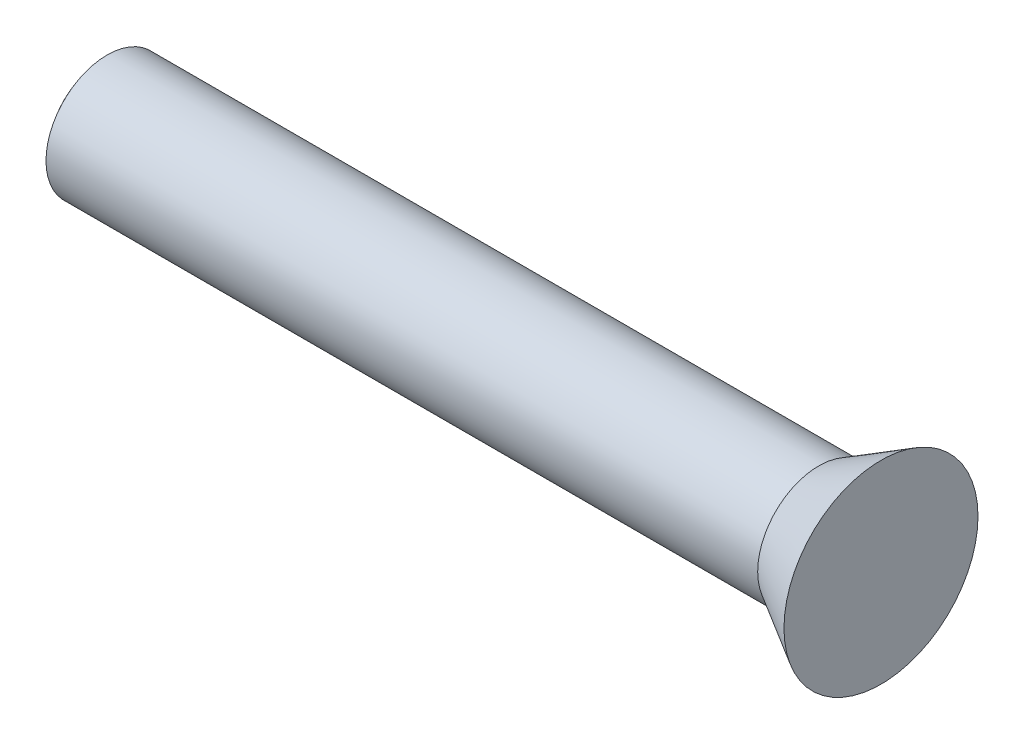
ISO-10303-21;
HEADER;
FILE_DESCRIPTION(('STEP AP214'),'2;1');
FILE_NAME('part.step','',(''),(''),'','','');
FILE_SCHEMA(('AUTOMOTIVE_DESIGN { 1 0 10303 214 1 1 1 1 }'));
ENDSEC;
DATA;
#1=APPLICATION_CONTEXT('core data for automotive mechanical design processes');
#2=APPLICATION_PROTOCOL_DEFINITION('international standard','automotive_design',2000,#1);
#3=PRODUCT_CONTEXT('',#1,'mechanical');
#4=PRODUCT('Part','Part','',(#3));
#5=PRODUCT_RELATED_PRODUCT_CATEGORY('part','',(#4));
#6=PRODUCT_DEFINITION_FORMATION('','',#4);
#7=PRODUCT_DEFINITION_CONTEXT('part definition',#1,'design');
#8=PRODUCT_DEFINITION('design','',#6,#7);
#9=PRODUCT_DEFINITION_SHAPE('','',#8);
#10=(LENGTH_UNIT() NAMED_UNIT(*) SI_UNIT(.MILLI.,.METRE.));
#11=(NAMED_UNIT(*) PLANE_ANGLE_UNIT() SI_UNIT($,.RADIAN.));
#12=(NAMED_UNIT(*) SI_UNIT($,.STERADIAN.) SOLID_ANGLE_UNIT());
#13=UNCERTAINTY_MEASURE_WITH_UNIT(LENGTH_MEASURE(1.E-05),#10,'distance_accuracy_value','');
#14=(GEOMETRIC_REPRESENTATION_CONTEXT(3) GLOBAL_UNCERTAINTY_ASSIGNED_CONTEXT((#13)) GLOBAL_UNIT_ASSIGNED_CONTEXT((#10,
#11,#12)) REPRESENTATION_CONTEXT('',''));
#15=CARTESIAN_POINT('',(0.,0.,0.));
#16=DIRECTION('',(0.,0.,1.));
#17=DIRECTION('',(1.,0.,0.));
#18=AXIS2_PLACEMENT_3D('',#15,#16,#17);
#19=CARTESIAN_POINT('',(0.,0.,0.));
#20=DIRECTION('',(-1.,0.,0.));
#21=DIRECTION('',(0.,1.,0.));
#22=AXIS2_PLACEMENT_3D('',#19,#20,#21);
#23=SPHERICAL_SURFACE('',#22,1.27);
#24=CARTESIAN_POINT('',(-0.986275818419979,0.,0.));
#25=DIRECTION('',(-1.,0.,0.));
#26=DIRECTION('',(0.,0.,1.));
#27=AXIS2_PLACEMENT_3D('',#24,#25,#26);
#28=CIRCLE('',#27,0.8001);
#29=CARTESIAN_POINT('',(-0.986275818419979,0.,0.8001));
#30=VERTEX_POINT('',#29);
#31=EDGE_CURVE('E10',#30,#30,#28,.T.);
#32=ORIENTED_EDGE('',*,*,#31,.T.);
#33=EDGE_LOOP('',(#32));
#34=FACE_BOUND('',#33,.T.);
#35=ADVANCED_FACE('F30',(#34),#23,.T.);
#36=CARTESIAN_POINT('',(19.688578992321,0.,0.));
#37=DIRECTION('',(-1.,0.,0.));
#38=DIRECTION('',(0.,0.,1.));
#39=AXIS2_PLACEMENT_3D('',#36,#37,#38);
#40=CYLINDRICAL_SURFACE('',#39,0.8001);
#41=ORIENTED_EDGE('',*,*,#31,.F.);
#42=EDGE_LOOP('',(#41));
#43=FACE_BOUND('',#42,.T.);
#44=CARTESIAN_POINT('',(8.33010932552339,0.,0.));
#45=DIRECTION('',(-1.,0.,0.));
#46=DIRECTION('',(0.,0.,1.));
#47=AXIS2_PLACEMENT_3D('',#44,#45,#46);
#48=CIRCLE('',#47,0.8001);
#49=CARTESIAN_POINT('',(8.33010932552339,0.,0.8001));
#50=VERTEX_POINT('',#49);
#51=EDGE_CURVE('E36',#50,#50,#48,.T.);
#52=ORIENTED_EDGE('',*,*,#51,.T.);
#53=EDGE_LOOP('',(#52));
#54=FACE_BOUND('',#53,.T.);
#55=ADVANCED_FACE('F55',(#43,#54),#40,.T.);
#56=CARTESIAN_POINT('',(9.144,0.,0.));
#57=DIRECTION('',(1.,0.,0.));
#58=DIRECTION('',(0.,0.,-1.));
#59=AXIS2_PLACEMENT_3D('',#56,#57,#58);
#60=CONICAL_SURFACE('',#59,1.27,0.5235987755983);
#61=ORIENTED_EDGE('',*,*,#51,.F.);
#62=EDGE_LOOP('',(#61));
#63=FACE_BOUND('',#62,.T.);
#64=CARTESIAN_POINT('',(9.144,0.,0.));
#65=DIRECTION('',(-1.,0.,0.));
#66=DIRECTION('',(0.,0.,1.));
#67=AXIS2_PLACEMENT_3D('',#64,#65,#66);
#68=CIRCLE('',#67,1.27);
#69=CARTESIAN_POINT('',(9.144,0.,1.27));
#70=VERTEX_POINT('',#69);
#71=EDGE_CURVE('E40',#70,#70,#68,.T.);
#72=ORIENTED_EDGE('',*,*,#71,.T.);
#73=EDGE_LOOP('',(#72));
#74=FACE_BOUND('',#73,.T.);
#75=ADVANCED_FACE('F47',(#63,#74),#60,.T.);
#76=CARTESIAN_POINT('',(9.144,1.27,0.));
#77=DIRECTION('',(-1.,0.,0.));
#78=DIRECTION('',(0.,0.,1.));
#79=AXIS2_PLACEMENT_3D('',#76,#77,#78);
#80=PLANE('',#79);
#81=ORIENTED_EDGE('',*,*,#71,.F.);
#82=EDGE_LOOP('',(#81));
#83=FACE_BOUND('',#82,.T.);
#84=ADVANCED_FACE('F49',(#83),#80,.F.);
#85=CLOSED_SHELL('',(#35,#55,#75,#84));
#86=MANIFOLD_SOLID_BREP('B2',#85);
#87=ADVANCED_BREP_SHAPE_REPRESENTATION('',(#18,#86),#14);
#88=SHAPE_DEFINITION_REPRESENTATION(#9,#87);
ENDSEC;
END-ISO-10303-21;
